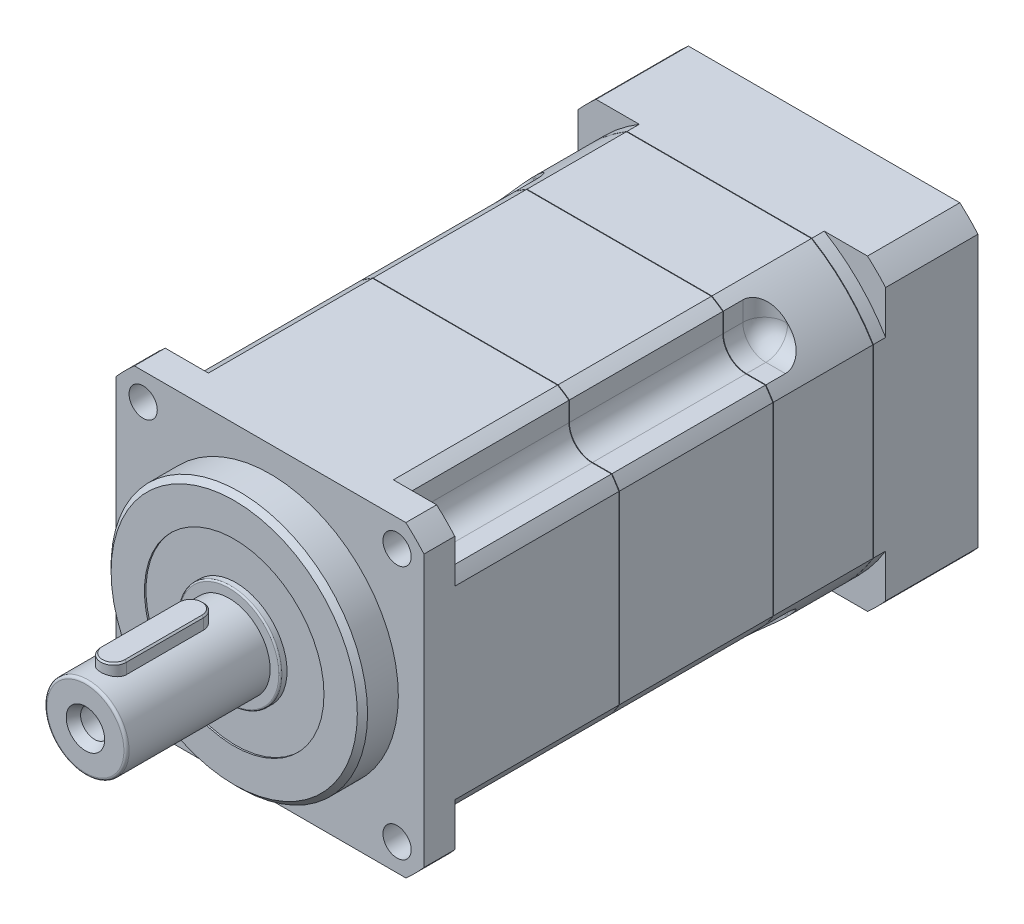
from build123d import *

# Parameters (mm, degrees)
EXTRUDE_1_DEPTH          = 6
SKETCH_2_R               = 25
EXTRUDE_2_DEPTH          = 7
EXTRUDE_3_DEPTH          = 32
SKETCH_4_W               = 13.908632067
SKETCH_4_H               = 13.141259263
CUT_EXTRUDE_1_DEPTH      = 32
PATTERN_CIRCULAR_1_COUNT = 4
FILLET_1_R               = 4.5
SKETCH_5_R               = 2.75
CUT_EXTRUDE_2_DEPTH      = 32
PATTERN_CIRCULAR_2_COUNT = 4
EXTRUDE_4_DEPTH          = 29.9
SKETCH_7_W               = 15.922985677
SKETCH_7_H               = 14.292318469
CUT_EXTRUDE_3_DEPTH      = 29.9
PATTERN_CIRCULAR_3_COUNT = 4
FILLET_2_R               = 4.5
CHAMFER_1_SIZE           = 1
EXTRUDE_5_DEPTH          = 19.4
SKETCH_9_W               = 10.182030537
SKETCH_9_H               = 12.103168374
CUT_EXTRUDE_4_DEPTH      = 8
PATTERN_CIRCULAR_4_COUNT = 4
FILLET_3_R               = 4.5
FILLET_4_R               = 4.2
EXTRUDE_6_DEPTH          = 2.4
EXTRUDE_START            = 18
EXTRUDE_7_DEPTH          = 18
SKETCH_12_R              = 25
CUT_EXTRUDE_5_DEPTH      = 5
SKETCH_13_R              = 4
CUT_EXTRUDE_6_DEPTH      = 12
PATTERN_CIRCULAR_5_COUNT = 4
SKETCH_14_R              = 4
CUT_EXTRUDE_7_DEPTH      = 12
PATTERN_CIRCULAR_6_COUNT = 2
PATTERN_CIRCULAR_7_COUNT = 4
SKETCH_17_R              = 19
CUT_EXTRUDE_8_DEPTH      = 13
SKETCH_18_R              = 16.5
EXTRUDE_8_DEPTH          = 11.5
CHAMFER_2_SIZE           = 1
SKETCH_19_R              = 3
EXTRUDE_9_DEPTH          = 6
PATTERN_CIRCULAR_8_COUNT = 4
SKETCH_20_R              = 3
EXTRUDE_10_DEPTH         = 6
PATTERN_CIRCULAR_9_COUNT = 2
SKETCH_21_R              = 7
CUT_EXTRUDE_9_DEPTH      = 34
SKETCH_22_W              = 35.733740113
SKETCH_22_H              = 1
CUT_EXTRUDE_10_DEPTH     = 11.5
SKETCH_23_R              = 8
EXTRUDE_11_DEPTH         = 29
FILLET_5_R               = 0.5
CUT_EXTRUDE_START        = -0.3
SKETCH_24_R              = 17.5
SKETCH_24_R_2            = 8
CUT_EXTRUDE_11_DEPTH     = 0.3
EXTRUDE_12_DEPTH         = 10
CHAMFER_3_SIZE           = 0.3
SKETCH_26_R              = 2.75
CUT_EXTRUDE_12_DEPTH     = 4.8
SKETCH_27_R              = 3.75
SKETCH_28_R              = 2.75
SKETCH_30_R              = 10
SKETCH_30_R_2            = 8
EXTRUDE_13_DEPTH         = 1.3
FILLET_6_R               = 0.3


with BuildPart() as part:
    # Sketch 1 → Extrude 1 (new body)
    with BuildSketch(Plane.XY):
        with BuildLine():
            Line((-26.457513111, 30), (26.457513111, 30))
            ThreePointArc((26.457513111, 30), (28.284271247, 28.284271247), (30, 26.457513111))
            Line((30, 26.457513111), (30, -26.457513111))
            ThreePointArc((30, -26.457513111), (28.284271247, -28.284271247), (26.457513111, -30))
            Line((26.457513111, -30), (-26.457513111, -30))
            ThreePointArc((-26.457513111, -30), (-28.284271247, -28.284271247), (-30, -26.457513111))
            Line((-30, -26.457513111), (-30, 26.457513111))
            ThreePointArc((-30, 26.457513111), (-28.284271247, 28.284271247), (-26.457513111, 30))
        make_face()
    extrude(amount=EXTRUDE_1_DEPTH)

    # Sketch 2 → Extrude 2 (add)
    with BuildSketch(Plane.XY.offset(6)):
        Circle(SKETCH_2_R)
    extrude(amount=EXTRUDE_2_DEPTH)

    # Sketch 3 → Extrude 3 (add)
    with BuildSketch(Plane(origin=(0, 0, 0), x_dir=(-1, 0, 0), z_dir=(0, 0, -1))):
        with BuildLine():
            Line((-18.027756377, 30), (18.027756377, 30))
            ThreePointArc((18.027756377, 30), (24.748737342, 24.748737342), (30, 18.027756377))
            Line((30, 18.027756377), (30, -18.027756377))
            ThreePointArc((30, -18.027756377), (24.748737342, -24.748737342), (18.027756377, -30))
            Line((18.027756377, -30), (-18.027756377, -30))
            ThreePointArc((-18.027756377, -30), (-24.748737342, -24.748737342), (-30, -18.027756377))
            Line((-30, -18.027756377), (-30, 18.027756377))
            ThreePointArc((-30, 18.027756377), (-24.748737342, 24.748737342), (-18.027756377, 30))
        make_face()
    extrude(amount=EXTRUDE_3_DEPTH)

    # Sketch 4 → Cut-Extrude 1 (cut)
    with BuildSketch(Plane(origin=(0, 0, -32), x_dir=(-1, 0, 0), z_dir=(0, 0, -1))):
        with Locations((-27.204316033, 26.820629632)):
            Rectangle(SKETCH_4_W, SKETCH_4_H)
    cut_extrude_1 = extrude(amount=-CUT_EXTRUDE_1_DEPTH, mode=Mode.SUBTRACT)

    # Pattern Circular 1: Cut-Extrude 1 ×4 about axis
    pattern_circular_1_axis = Axis((0, 0, 0), (0, 0, 1))
    for i in range(1, PATTERN_CIRCULAR_1_COUNT):
        add(cut_extrude_1.rotate(pattern_circular_1_axis, i * 360 / PATTERN_CIRCULAR_1_COUNT), mode=Mode.SUBTRACT)

    # Fillet 1
    fillet_1_edges = [part.edges().sort_by_distance(p)[0] for p in [
        (-20.25, -20.25, -16),
        (20.25, -20.25, -16),
        (20.25, 20.25, -16),
        (-20.25, 20.25, -16),
    ]]
    fillet(fillet_1_edges, radius=FILLET_1_R)

    # Sketch 5 → Cut-Extrude 2 (cut)
    with BuildSketch(Plane.XY.offset(6)):
        with Locations((-24.748737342, 24.748737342)):
            Circle(SKETCH_5_R)
    cut_extrude_2 = extrude(amount=-CUT_EXTRUDE_2_DEPTH, mode=Mode.SUBTRACT)

    # Pattern Circular 2: Cut-Extrude 2 ×4 about axis
    pattern_circular_2_axis = Axis((0, 0, 0), (0, 0, 1))
    for i in range(1, PATTERN_CIRCULAR_2_COUNT):
        add(cut_extrude_2.rotate(pattern_circular_2_axis, i * 360 / PATTERN_CIRCULAR_2_COUNT), mode=Mode.SUBTRACT)

    # Chamfer 1
    chamfer_1_edges = [part.edges().sort_by_distance(p)[0] for p in [
        (-25, 0, 13),
    ]]
    chamfer(chamfer_1_edges, length=CHAMFER_1_SIZE)

    # Sketch 23 → Extrude 11 (add)
    with BuildSketch(Plane.XY.offset(13)):
        with Locations(Location((0, 0, 0), (0, 0, 180))):
            Circle(SKETCH_23_R)
    extrude(amount=EXTRUDE_11_DEPTH)

    # Fillet 5
    fillet_5_edges = [part.edges().sort_by_distance(p)[0] for p in [
        (8, 0, 42),
    ]]
    fillet(fillet_5_edges, radius=FILLET_5_R)

    # Sketch 24 → Cut-Extrude 11 (cut)
    with BuildSketch(Plane.XY.offset(13).offset(CUT_EXTRUDE_START)):
        Circle(SKETCH_24_R)
        with Locations(Location((0, 0, 0), (0, 0, 180))):
            Circle(SKETCH_24_R_2, mode=Mode.SUBTRACT)
    extrude(amount=CUT_EXTRUDE_11_DEPTH, mode=Mode.SUBTRACT)

    # Sketch 25 → Extrude 12 (add)
    with BuildSketch(Plane(origin=(0, 0, 0), x_dir=(1, 0, 0), z_dir=(0, 1, 0))):
        with BuildLine():
            Line((-2.5, -36.5), (-2.5, -21.5))
            ThreePointArc((-2.5, -21.5), (0, -19), (2.5, -21.5))
            Line((2.5, -21.5), (2.5, -36.5))
            ThreePointArc((2.5, -36.5), (0, -39), (-2.5, -36.5))
        make_face()
    extrude(amount=EXTRUDE_12_DEPTH)

    # Chamfer 3
    chamfer_3_edges = [part.edges().sort_by_distance(p)[0] for p in [
        (0, 10, 39),
        (2.5, 10, 29),
        (0, 10, 19),
        (-2.5, 10, 29),
    ]]
    chamfer(chamfer_3_edges, length=CHAMFER_3_SIZE)

    # Sketch 26 → Cut-Extrude 12 (cut)
    with BuildSketch(Plane.XY.offset(42)):
        Circle(SKETCH_26_R)
    extrude(amount=-CUT_EXTRUDE_12_DEPTH, mode=Mode.SUBTRACT)

    # Sketch 27 → Loft 1 section 0
    with BuildSketch(Plane.XY.offset(42)):
        Circle(SKETCH_27_R)
    # Sketch 28 → Loft 1 section 1
    with BuildSketch(Plane.XY.offset(40.2)):
        Circle(SKETCH_28_R)
    loft(mode=Mode.SUBTRACT)

    # Sketch 29 → Hole Wizard M5 _1 (revolve, cut)
    with BuildSketch(Plane(origin=(0, 0, 37.2), x_dir=(0, -1, 0), z_dir=(1, 0, 0))):
        Polygon((0, 0), (0, 20.4618073), (2.1, 19.2), (2.1, 0), align=None)
    revolve(axis=Axis((0, 0, 43.55), (0, 0, -1)), mode=Mode.SUBTRACT)

    # Sketch 30 → Extrude 13 (add)
    with BuildSketch(Plane.XY.offset(12.7)):
        Circle(SKETCH_30_R)
        Circle(SKETCH_30_R_2, mode=Mode.SUBTRACT)
    extrude(amount=EXTRUDE_13_DEPTH)

    # Fillet 6
    fillet_6_edges = [part.edges().sort_by_distance(p)[0] for p in [
        (-10, 0, 14),
    ]]
    fillet(fillet_6_edges, radius=FILLET_6_R)


with BuildPart() as body_2:
    # Sketch 6 → Extrude 4 (new body)
    with BuildSketch(Plane(origin=(0, 0, -32.1), x_dir=(-1, 0, 0), z_dir=(0, 0, -1))):
        with BuildLine():
            Line((-18.027756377, 30), (18.027756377, 30))
            ThreePointArc((18.027756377, 30), (24.748737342, 24.748737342), (30, 18.027756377))
            Line((30, 18.027756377), (30, -18.027756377))
            ThreePointArc((30, -18.027756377), (24.748737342, -24.748737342), (18.027756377, -30))
            Line((18.027756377, -30), (-18.027756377, -30))
            ThreePointArc((-18.027756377, -30), (-24.748737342, -24.748737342), (-30, -18.027756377))
            Line((-30, -18.027756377), (-30, 18.027756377))
            ThreePointArc((-30, 18.027756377), (-24.748737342, 24.748737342), (-18.027756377, 30))
        make_face()
    extrude(amount=EXTRUDE_4_DEPTH)

    # Sketch 7 → Cut-Extrude 3 (cut)
    with BuildSketch(Plane.XY.offset(-32.1)):
        with Locations((-28.211492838, 27.396159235)):
            Rectangle(SKETCH_7_W, SKETCH_7_H)
    cut_extrude_3 = extrude(amount=-CUT_EXTRUDE_3_DEPTH, mode=Mode.SUBTRACT)

    # Pattern Circular 3: Cut-Extrude 3 ×4 about axis
    pattern_circular_3_axis = Axis((0, 0, 0), (0, 0, 1))
    for i in range(1, PATTERN_CIRCULAR_3_COUNT):
        add(cut_extrude_3.rotate(pattern_circular_3_axis, i * 360 / PATTERN_CIRCULAR_3_COUNT), mode=Mode.SUBTRACT)

    # Fillet 2
    fillet_2_edges = [body_2.edges().sort_by_distance(p)[0] for p in [
        (-20.25, 20.25, -47.05),
        (-20.25, -20.25, -47.05),
        (20.25, -20.25, -47.05),
        (20.25, 20.25, -47.05),
    ]]
    fillet(fillet_2_edges, radius=FILLET_2_R)


with BuildPart() as body_3:
    # Sketch 8 → Extrude 5 (new body)
    with BuildSketch(Plane(origin=(0, 0, -62.1), x_dir=(-1, 0, 0), z_dir=(0, 0, -1))):
        with BuildLine():
            Line((-18.027756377, 30), (18.027756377, 30))
            ThreePointArc((18.027756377, 30), (24.748737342, 24.748737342), (30, 18.027756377))
            Line((30, 18.027756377), (30, -18.027756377))
            ThreePointArc((30, -18.027756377), (24.748737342, -24.748737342), (18.027756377, -30))
            Line((18.027756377, -30), (-18.027756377, -30))
            ThreePointArc((-18.027756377, -30), (-24.748737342, -24.748737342), (-30, -18.027756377))
            Line((-30, -18.027756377), (-30, 18.027756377))
            ThreePointArc((-30, 18.027756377), (-24.748737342, 24.748737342), (-18.027756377, 30))
        make_face()
    extrude(amount=EXTRUDE_5_DEPTH)

    # Sketch 9 → Cut-Extrude 4 (cut)
    with BuildSketch(Plane.XY.offset(-62.1)):
        with Locations((-25.341015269, 26.301584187)):
            Rectangle(SKETCH_9_W, SKETCH_9_H)
    cut_extrude_4 = extrude(amount=-CUT_EXTRUDE_4_DEPTH, mode=Mode.SUBTRACT)

    # Pattern Circular 4: Cut-Extrude 4 ×4 about axis
    pattern_circular_4_axis = Axis((0, 0, 0), (0, 0, 1))
    for i in range(1, PATTERN_CIRCULAR_4_COUNT):
        add(cut_extrude_4.rotate(pattern_circular_4_axis, i * 360 / PATTERN_CIRCULAR_4_COUNT), mode=Mode.SUBTRACT)

    # Fillet 3
    fillet_3_edges = [body_3.edges().sort_by_distance(p)[0] for p in [
        (-20.25, 20.25, -66.1),
        (-20.25, -20.25, -66.1),
        (20.25, -20.25, -66.1),
        (20.25, 20.25, -66.1),
    ]]
    fillet(fillet_3_edges, radius=FILLET_3_R)

    # Fillet 4
    fillet_4_edges = [body_3.edges().sort_by_distance(p)[0] for p in [
        (21.568019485, 21.568019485, -70.1),
        (-20.25, 26.648555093, -70.1),
        (-21.568019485, 21.568019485, -70.1),
        (-26.648555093, 20.25, -70.1),
        (-20.25, -26.648555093, -70.1),
        (26.648555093, -20.25, -70.1),
        (20.25, 26.648555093, -70.1),
        (-26.648555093, -20.25, -70.1),
        (-21.568019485, -21.568019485, -70.1),
        (20.25, -26.648555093, -70.1),
        (21.568019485, -21.568019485, -70.1),
        (26.648555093, 20.25, -70.1),
    ]]
    fillet(fillet_4_edges, radius=FILLET_4_R)


with BuildPart() as body_4:
    # Sketch 10 → Extrude 6 (new body)
    with BuildSketch(Plane(origin=(0, 0, -81.6), x_dir=(-1, 0, 0), z_dir=(0, 0, -1))):
        with BuildLine():
            Line((18.027756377, 30), (-18.027756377, 30))
            ThreePointArc((-18.027756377, 30), (-24.748737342, 24.748737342), (-30, 18.027756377))
            Line((-30, 18.027756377), (-30, -18.027756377))
            ThreePointArc((-30, -18.027756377), (-24.748737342, -24.748737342), (-18.027756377, -30))
            Line((-18.027756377, -30), (18.027756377, -30))
            ThreePointArc((18.027756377, -30), (24.748737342, -24.748737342), (30, -18.027756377))
            Line((30, -18.027756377), (30, 18.027756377))
            ThreePointArc((30, 18.027756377), (24.748737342, 24.748737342), (18.027756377, 30))
        make_face()
    extrude(amount=EXTRUDE_6_DEPTH)

    # Sketch 11 → Extrude 7 (add)
    with BuildSketch(Plane(origin=(0, 0, -84), x_dir=(-1, 0, 0), z_dir=(0, 0, -1)).offset(EXTRUDE_START)):
        with BuildLine():
            Line((-26.457513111, 30), (26.457513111, 30))
            ThreePointArc((26.457513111, 30), (28.284271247, 28.284271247), (30, 26.457513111))
            Line((30, 26.457513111), (30, -26.457513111))
            ThreePointArc((30, -26.457513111), (28.284271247, -28.284271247), (26.457513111, -30))
            Line((26.457513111, -30), (-26.457513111, -30))
            ThreePointArc((-26.457513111, -30), (-28.284271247, -28.284271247), (-30, -26.457513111))
            Line((-30, -26.457513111), (-30, 26.457513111))
            ThreePointArc((-30, 26.457513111), (-28.284271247, 28.284271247), (-26.457513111, 30))
        make_face()
    extrude(amount=-EXTRUDE_7_DEPTH)

    # Sketch 12 → Cut-Extrude 5 (cut)
    with BuildSketch(Plane(origin=(0, 0, -102), x_dir=(-1, 0, 0), z_dir=(0, 0, -1))):
        Circle(SKETCH_12_R)
    extrude(amount=-CUT_EXTRUDE_5_DEPTH, mode=Mode.SUBTRACT)

    # Sketch 13 → Cut-Extrude 6 (cut)
    with BuildSketch(Plane(origin=(0, 0, -102), x_dir=(-1, 0, 0), z_dir=(0, 0, -1))):
        with Locations((6.470476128, -24.148145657)):
            Circle(SKETCH_13_R)
    cut_extrude_6 = extrude(amount=-CUT_EXTRUDE_6_DEPTH, mode=Mode.SUBTRACT)

    # Pattern Circular 5: Cut-Extrude 6 ×4 about axis
    pattern_circular_5_axis = Axis((0, 0, 0), (0, 0, 1))
    for i in range(1, PATTERN_CIRCULAR_5_COUNT):
        add(cut_extrude_6.rotate(pattern_circular_5_axis, i * 360 / PATTERN_CIRCULAR_5_COUNT), mode=Mode.SUBTRACT)

    # Sketch 14 → Cut-Extrude 7 (cut)
    with BuildSketch(Plane(origin=(0, 0, -102), x_dir=(-1, 0, 0), z_dir=(0, 0, -1))):
        with Locations((-15.733009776, -19.428649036)):
            Circle(SKETCH_14_R)
    cut_extrude_7 = extrude(amount=-CUT_EXTRUDE_7_DEPTH, mode=Mode.SUBTRACT)

    # Pattern Circular 6: Cut-Extrude 7 ×2 about axis
    pattern_circular_6_axis = Axis((0, 0, 0), (0, 0, 1))
    for i in range(1, PATTERN_CIRCULAR_6_COUNT):
        add(cut_extrude_7.rotate(pattern_circular_6_axis, i * 360 / PATTERN_CIRCULAR_6_COUNT), mode=Mode.SUBTRACT)

    # Sketch 16 → Hole Wizard M4 _1 (revolve, cut)
    with BuildSketch(Plane(origin=(24.748737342, -24.748737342, -102), x_dir=(0, 1, 0), z_dir=(1, 0, 0))):
        Polygon((0, 0), (0, 16.491420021), (1.65, 15.5), (1.65, 0), align=None)
    hole_wizard_m4_1 = revolve(axis=Axis((24.748737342, -24.748737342, -108.35), (0, 0, 1)), mode=Mode.SUBTRACT)

    # Pattern Circular 7: Hole Wizard M4 _1 ×4 about axis
    pattern_circular_7_axis = Axis((0, 0, 0), (0, 0, 1))
    for i in range(1, PATTERN_CIRCULAR_7_COUNT):
        add(hole_wizard_m4_1.rotate(pattern_circular_7_axis, i * 360 / PATTERN_CIRCULAR_7_COUNT), mode=Mode.SUBTRACT)

    # Sketch 17 → Cut-Extrude 8 (cut)
    with BuildSketch(Plane(origin=(0, 0, -97), x_dir=(-1, 0, 0), z_dir=(0, 0, -1))):
        Circle(SKETCH_17_R)
    extrude(amount=-CUT_EXTRUDE_8_DEPTH, mode=Mode.SUBTRACT)

    # Sketch 18 → Extrude 8 (add)
    with BuildSketch(Plane(origin=(0, 0, -84), x_dir=(-1, 0, 0), z_dir=(0, 0, -1))):
        Circle(SKETCH_18_R)
    extrude(amount=EXTRUDE_8_DEPTH)

    # Chamfer 2
    chamfer_2_edges = [body_4.edges().sort_by_distance(p)[0] for p in [
        (16.5, 0, -95.5),
    ]]
    chamfer(chamfer_2_edges, length=CHAMFER_2_SIZE)

    # Sketch 19 → Extrude 9 (add)
    with BuildSketch(Plane(origin=(0, 0, -90), x_dir=(-1, 0, 0), z_dir=(0, 0, -1))):
        with Locations((-6.470476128, 24.148145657)):
            Circle(SKETCH_19_R)
        Polygon((-5.41087373, 26.024333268), (-7.565501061, 26.003882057), (-8.625103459, 24.127694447), (-7.530078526, 22.271958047), (-5.375451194, 22.292409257), (-4.315848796, 24.168596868), align=None, mode=Mode.SUBTRACT)
    extrude_9 = extrude(amount=EXTRUDE_9_DEPTH)

    # Pattern Circular 8: Extrude 9 ×4 about axis
    pattern_circular_8_axis = Axis((0, 0, 0), (0, 0, 1))
    for i in range(1, PATTERN_CIRCULAR_8_COUNT):
        add(extrude_9.rotate(pattern_circular_8_axis, i * 360 / PATTERN_CIRCULAR_8_COUNT))

    # Sketch 20 → Extrude 10 (add)
    with BuildSketch(Plane(origin=(0, 0, -90), x_dir=(-1, 0, 0), z_dir=(0, 0, -1))):
        with Locations((-15.733009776, -19.428649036)):
            Circle(SKETCH_20_R)
        Polygon((-14.858325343, -17.800975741), (-16.705273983, -17.857313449), (-17.579958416, -19.484986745), (-16.60769421, -21.056322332), (-14.76074557, -20.999984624), (-13.886061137, -19.372311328), align=None, mode=Mode.SUBTRACT)
    extrude_10 = extrude(amount=EXTRUDE_10_DEPTH)

    # Pattern Circular 9: Extrude 10 ×2 about axis
    pattern_circular_9_axis = Axis((0, 0, 0), (0, 0, 1))
    for i in range(1, PATTERN_CIRCULAR_9_COUNT):
        add(extrude_10.rotate(pattern_circular_9_axis, i * 360 / PATTERN_CIRCULAR_9_COUNT))

    # Sketch 21 → Cut-Extrude 9 (cut)
    with BuildSketch(Plane(origin=(0, 0, -102), x_dir=(-1, 0, 0), z_dir=(0, 0, -1))):
        Circle(SKETCH_21_R)
    extrude(amount=-CUT_EXTRUDE_9_DEPTH, mode=Mode.SUBTRACT)

    # Sketch 22 → Cut-Extrude 10 (cut)
    with BuildSketch(Plane(origin=(0, 0, -95.5), x_dir=(-1, 0, 0), z_dir=(0, 0, -1))):
        with Locations((0.208257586, 0)):
            Rectangle(SKETCH_22_W, SKETCH_22_H)
    extrude(amount=-CUT_EXTRUDE_10_DEPTH, mode=Mode.SUBTRACT)


solid = Compound([part.part, body_2.part, body_3.part, body_4.part])
